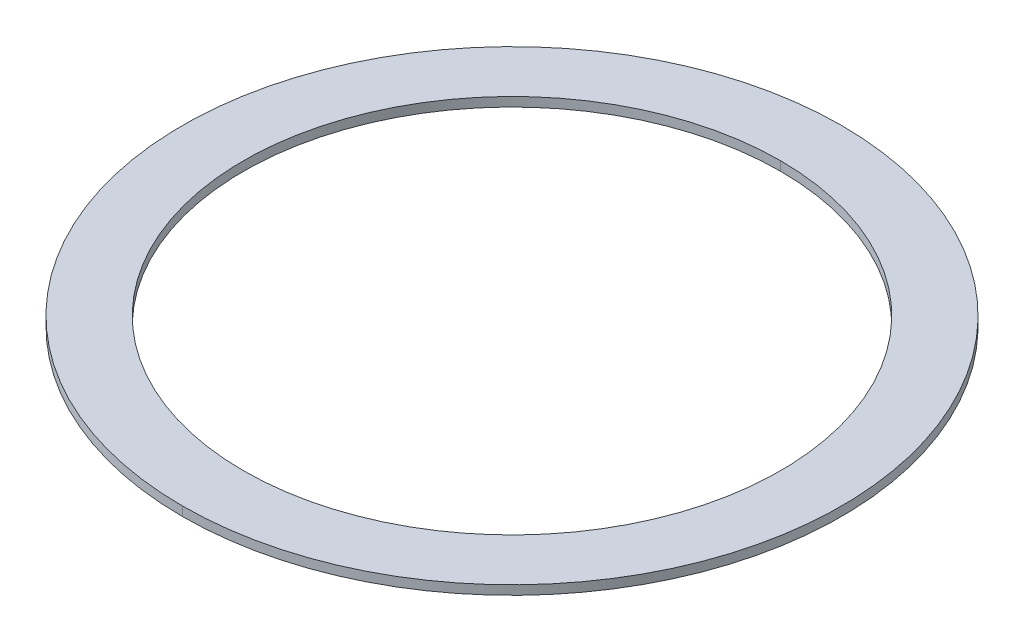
ISO-10303-21;
HEADER;
FILE_DESCRIPTION(('STEP AP214'),'2;1');
FILE_NAME('part.step','',(''),(''),'','','');
FILE_SCHEMA(('AUTOMOTIVE_DESIGN { 1 0 10303 214 1 1 1 1 }'));
ENDSEC;
DATA;
#1=APPLICATION_CONTEXT('core data for automotive mechanical design processes');
#2=APPLICATION_PROTOCOL_DEFINITION('international standard','automotive_design',2000,#1);
#3=PRODUCT_CONTEXT('',#1,'mechanical');
#4=PRODUCT('Part','Part','',(#3));
#5=PRODUCT_RELATED_PRODUCT_CATEGORY('part','',(#4));
#6=PRODUCT_DEFINITION_FORMATION('','',#4);
#7=PRODUCT_DEFINITION_CONTEXT('part definition',#1,'design');
#8=PRODUCT_DEFINITION('design','',#6,#7);
#9=PRODUCT_DEFINITION_SHAPE('','',#8);
#10=(LENGTH_UNIT() NAMED_UNIT(*) SI_UNIT(.MILLI.,.METRE.));
#11=(NAMED_UNIT(*) PLANE_ANGLE_UNIT() SI_UNIT($,.RADIAN.));
#12=(NAMED_UNIT(*) SI_UNIT($,.STERADIAN.) SOLID_ANGLE_UNIT());
#13=UNCERTAINTY_MEASURE_WITH_UNIT(LENGTH_MEASURE(1.E-05),#10,'distance_accuracy_value','');
#14=(GEOMETRIC_REPRESENTATION_CONTEXT(3) GLOBAL_UNCERTAINTY_ASSIGNED_CONTEXT((#13)) GLOBAL_UNIT_ASSIGNED_CONTEXT((#10,
#11,#12)) REPRESENTATION_CONTEXT('',''));
#15=CARTESIAN_POINT('',(0.,0.,0.));
#16=DIRECTION('',(0.,0.,1.));
#17=DIRECTION('',(1.,0.,0.));
#18=AXIS2_PLACEMENT_3D('',#15,#16,#17);
#19=CARTESIAN_POINT('',(0.,3.,0.));
#20=DIRECTION('',(0.,-1.,0.));
#21=DIRECTION('',(0.,0.,-1.));
#22=AXIS2_PLACEMENT_3D('',#19,#20,#21);
#23=CYLINDRICAL_SURFACE('',#22,88.);
#24=DIRECTION('',(0.,-1.,0.));
#25=VECTOR('',#24,1.);
#26=CARTESIAN_POINT('',(0.,3.,88.));
#27=LINE('',#26,#25);
#28=CARTESIAN_POINT('',(0.,3.,88.));
#29=VERTEX_POINT('',#28);
#30=CARTESIAN_POINT('',(0.,0.,88.));
#31=VERTEX_POINT('',#30);
#32=EDGE_CURVE('E88',#29,#31,#27,.T.);
#33=ORIENTED_EDGE('',*,*,#32,.F.);
#34=CARTESIAN_POINT('',(0.,3.,0.));
#35=DIRECTION('',(0.,1.,0.));
#36=DIRECTION('',(0.,0.,1.));
#37=AXIS2_PLACEMENT_3D('',#34,#35,#36);
#38=CIRCLE('',#37,88.);
#39=CARTESIAN_POINT('',(0.,3.,-88.));
#40=VERTEX_POINT('',#39);
#41=EDGE_CURVE('E21',#29,#40,#38,.T.);
#42=ORIENTED_EDGE('',*,*,#41,.T.);
#43=DIRECTION('',(0.,-1.,0.));
#44=VECTOR('',#43,1.);
#45=CARTESIAN_POINT('',(0.,3.,-88.));
#46=LINE('',#45,#44);
#47=CARTESIAN_POINT('',(0.,0.,-88.));
#48=VERTEX_POINT('',#47);
#49=EDGE_CURVE('E85',#40,#48,#46,.T.);
#50=ORIENTED_EDGE('',*,*,#49,.T.);
#51=CARTESIAN_POINT('',(0.,0.,0.));
#52=DIRECTION('',(0.,1.,0.));
#53=DIRECTION('',(0.,0.,1.));
#54=AXIS2_PLACEMENT_3D('',#51,#52,#53);
#55=CIRCLE('',#54,88.);
#56=EDGE_CURVE('E11',#31,#48,#55,.T.);
#57=ORIENTED_EDGE('',*,*,#56,.F.);
#58=EDGE_LOOP('',(#33,#42,#50,#57));
#59=FACE_BOUND('',#58,.T.);
#60=ADVANCED_FACE('F17',(#59),#23,.F.);
#61=CARTESIAN_POINT('',(0.,3.,0.));
#62=DIRECTION('',(0.,-1.,0.));
#63=DIRECTION('',(0.,0.,-1.));
#64=AXIS2_PLACEMENT_3D('',#61,#62,#63);
#65=CYLINDRICAL_SURFACE('',#64,108.);
#66=DIRECTION('',(0.,-1.,0.));
#67=VECTOR('',#66,1.);
#68=CARTESIAN_POINT('',(0.,3.,108.));
#69=LINE('',#68,#67);
#70=CARTESIAN_POINT('',(0.,3.,108.));
#71=VERTEX_POINT('',#70);
#72=CARTESIAN_POINT('',(0.,0.,108.));
#73=VERTEX_POINT('',#72);
#74=EDGE_CURVE('E115',#71,#73,#69,.T.);
#75=ORIENTED_EDGE('',*,*,#74,.F.);
#76=CARTESIAN_POINT('',(0.,3.,0.));
#77=DIRECTION('',(0.,1.,0.));
#78=DIRECTION('',(0.,0.,1.));
#79=AXIS2_PLACEMENT_3D('',#76,#77,#78);
#80=CIRCLE('',#79,108.);
#81=CARTESIAN_POINT('',(0.,3.,-108.));
#82=VERTEX_POINT('',#81);
#83=EDGE_CURVE('E91',#82,#71,#80,.T.);
#84=ORIENTED_EDGE('',*,*,#83,.F.);
#85=DIRECTION('',(0.,-1.,0.));
#86=VECTOR('',#85,1.);
#87=CARTESIAN_POINT('',(0.,3.,-108.));
#88=LINE('',#87,#86);
#89=CARTESIAN_POINT('',(0.,0.,-108.));
#90=VERTEX_POINT('',#89);
#91=EDGE_CURVE('E120',#82,#90,#88,.T.);
#92=ORIENTED_EDGE('',*,*,#91,.T.);
#93=CARTESIAN_POINT('',(0.,0.,0.));
#94=DIRECTION('',(0.,1.,0.));
#95=DIRECTION('',(0.,0.,1.));
#96=AXIS2_PLACEMENT_3D('',#93,#94,#95);
#97=CIRCLE('',#96,108.);
#98=EDGE_CURVE('E27',#90,#73,#97,.T.);
#99=ORIENTED_EDGE('',*,*,#98,.T.);
#100=EDGE_LOOP('',(#75,#84,#92,#99));
#101=FACE_BOUND('',#100,.T.);
#102=ADVANCED_FACE('F19',(#101),#65,.T.);
#103=CARTESIAN_POINT('',(0.,0.,0.));
#104=DIRECTION('',(0.,1.,0.));
#105=DIRECTION('',(1.,0.,0.));
#106=AXIS2_PLACEMENT_3D('',#103,#104,#105);
#107=PLANE('',#106);
#108=CARTESIAN_POINT('',(0.,0.,0.));
#109=DIRECTION('',(0.,1.,0.));
#110=DIRECTION('',(0.,0.,1.));
#111=AXIS2_PLACEMENT_3D('',#108,#109,#110);
#112=CIRCLE('',#111,88.);
#113=EDGE_CURVE('E95',#48,#31,#112,.T.);
#114=ORIENTED_EDGE('',*,*,#113,.T.);
#115=ORIENTED_EDGE('',*,*,#56,.T.);
#116=EDGE_LOOP('',(#114,#115));
#117=FACE_BOUND('',#116,.T.);
#118=ORIENTED_EDGE('',*,*,#98,.F.);
#119=CARTESIAN_POINT('',(0.,0.,0.));
#120=DIRECTION('',(0.,1.,0.));
#121=DIRECTION('',(0.,0.,1.));
#122=AXIS2_PLACEMENT_3D('',#119,#120,#121);
#123=CIRCLE('',#122,108.);
#124=EDGE_CURVE('E116',#73,#90,#123,.T.);
#125=ORIENTED_EDGE('',*,*,#124,.F.);
#126=EDGE_LOOP('',(#118,#125));
#127=FACE_BOUND('',#126,.T.);
#128=ADVANCED_FACE('F132',(#117,#127),#107,.F.);
#129=CARTESIAN_POINT('',(0.,3.,0.));
#130=DIRECTION('',(0.,1.,0.));
#131=DIRECTION('',(1.,0.,0.));
#132=AXIS2_PLACEMENT_3D('',#129,#130,#131);
#133=PLANE('',#132);
#134=CARTESIAN_POINT('',(0.,3.,0.));
#135=DIRECTION('',(0.,1.,0.));
#136=DIRECTION('',(0.,0.,1.));
#137=AXIS2_PLACEMENT_3D('',#134,#135,#136);
#138=CIRCLE('',#137,88.);
#139=EDGE_CURVE('E94',#40,#29,#138,.T.);
#140=ORIENTED_EDGE('',*,*,#139,.F.);
#141=ORIENTED_EDGE('',*,*,#41,.F.);
#142=EDGE_LOOP('',(#140,#141));
#143=FACE_BOUND('',#142,.T.);
#144=ORIENTED_EDGE('',*,*,#83,.T.);
#145=CARTESIAN_POINT('',(0.,3.,0.));
#146=DIRECTION('',(0.,1.,0.));
#147=DIRECTION('',(0.,0.,1.));
#148=AXIS2_PLACEMENT_3D('',#145,#146,#147);
#149=CIRCLE('',#148,108.);
#150=EDGE_CURVE('E97',#71,#82,#149,.T.);
#151=ORIENTED_EDGE('',*,*,#150,.T.);
#152=EDGE_LOOP('',(#144,#151));
#153=FACE_BOUND('',#152,.T.);
#154=ADVANCED_FACE('F99',(#143,#153),#133,.T.);
#155=CARTESIAN_POINT('',(0.,3.,0.));
#156=DIRECTION('',(0.,-1.,0.));
#157=DIRECTION('',(0.,0.,-1.));
#158=AXIS2_PLACEMENT_3D('',#155,#156,#157);
#159=CYLINDRICAL_SURFACE('',#158,108.);
#160=ORIENTED_EDGE('',*,*,#150,.F.);
#161=ORIENTED_EDGE('',*,*,#74,.T.);
#162=ORIENTED_EDGE('',*,*,#124,.T.);
#163=ORIENTED_EDGE('',*,*,#91,.F.);
#164=EDGE_LOOP('',(#160,#161,#162,#163));
#165=FACE_BOUND('',#164,.T.);
#166=ADVANCED_FACE('F131',(#165),#159,.T.);
#167=CARTESIAN_POINT('',(0.,3.,0.));
#168=DIRECTION('',(0.,-1.,0.));
#169=DIRECTION('',(0.,0.,-1.));
#170=AXIS2_PLACEMENT_3D('',#167,#168,#169);
#171=CYLINDRICAL_SURFACE('',#170,88.);
#172=ORIENTED_EDGE('',*,*,#139,.T.);
#173=ORIENTED_EDGE('',*,*,#32,.T.);
#174=ORIENTED_EDGE('',*,*,#113,.F.);
#175=ORIENTED_EDGE('',*,*,#49,.F.);
#176=EDGE_LOOP('',(#172,#173,#174,#175));
#177=FACE_BOUND('',#176,.T.);
#178=ADVANCED_FACE('F93',(#177),#171,.F.);
#179=CLOSED_SHELL('',(#60,#102,#128,#154,#166,#178));
#180=MANIFOLD_SOLID_BREP('B1',#179);
#181=ADVANCED_BREP_SHAPE_REPRESENTATION('',(#18,#180),#14);
#182=SHAPE_DEFINITION_REPRESENTATION(#9,#181);
ENDSEC;
END-ISO-10303-21;
